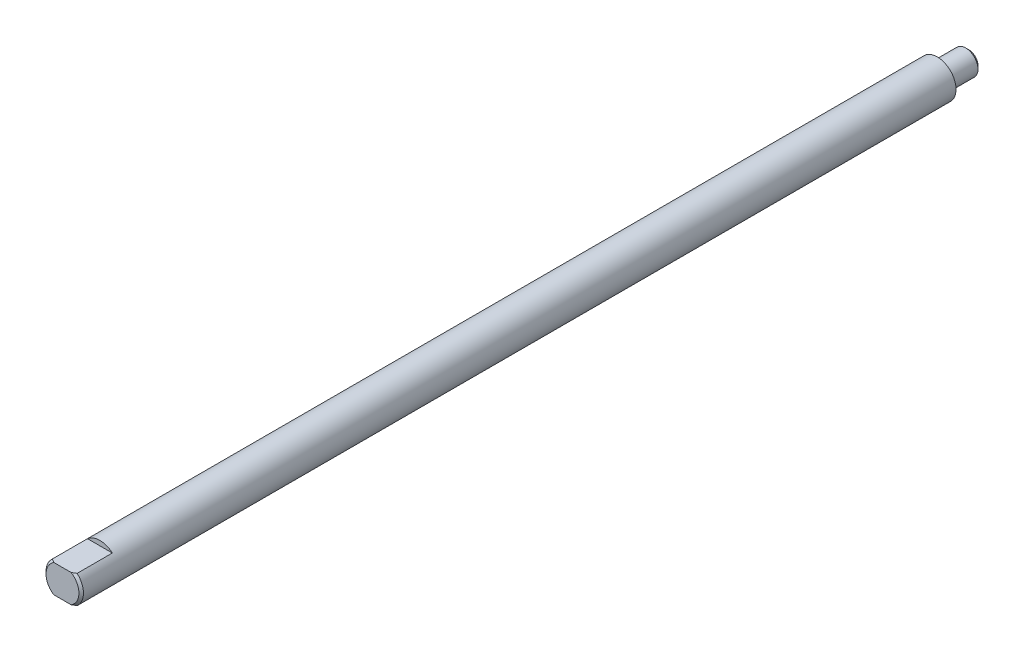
ISO-10303-21;
HEADER;
FILE_DESCRIPTION(('STEP AP214'),'2;1');
FILE_NAME('part.step','',(''),(''),'','','');
FILE_SCHEMA(('AUTOMOTIVE_DESIGN { 1 0 10303 214 1 1 1 1 }'));
ENDSEC;
DATA;
#1=APPLICATION_CONTEXT('core data for automotive mechanical design processes');
#2=APPLICATION_PROTOCOL_DEFINITION('international standard','automotive_design',2000,#1);
#3=PRODUCT_CONTEXT('',#1,'mechanical');
#4=PRODUCT('Part','Part','',(#3));
#5=PRODUCT_RELATED_PRODUCT_CATEGORY('part','',(#4));
#6=PRODUCT_DEFINITION_FORMATION('','',#4);
#7=PRODUCT_DEFINITION_CONTEXT('part definition',#1,'design');
#8=PRODUCT_DEFINITION('design','',#6,#7);
#9=PRODUCT_DEFINITION_SHAPE('','',#8);
#10=(LENGTH_UNIT() NAMED_UNIT(*) SI_UNIT(.MILLI.,.METRE.));
#11=(NAMED_UNIT(*) PLANE_ANGLE_UNIT() SI_UNIT($,.RADIAN.));
#12=(NAMED_UNIT(*) SI_UNIT($,.STERADIAN.) SOLID_ANGLE_UNIT());
#13=UNCERTAINTY_MEASURE_WITH_UNIT(LENGTH_MEASURE(1.E-05),#10,'distance_accuracy_value','');
#14=(GEOMETRIC_REPRESENTATION_CONTEXT(3) GLOBAL_UNCERTAINTY_ASSIGNED_CONTEXT((#13)) GLOBAL_UNIT_ASSIGNED_CONTEXT((#10,
#11,#12)) REPRESENTATION_CONTEXT('',''));
#15=CARTESIAN_POINT('',(0.,0.,0.));
#16=DIRECTION('',(0.,0.,1.));
#17=DIRECTION('',(1.,0.,0.));
#18=AXIS2_PLACEMENT_3D('',#15,#16,#17);
#19=CARTESIAN_POINT('',(0.,0.,3.684));
#20=DIRECTION('',(0.,0.,-1.));
#21=DIRECTION('',(-1.,0.,0.));
#22=AXIS2_PLACEMENT_3D('',#19,#20,#21);
#23=CONICAL_SURFACE('',#22,3.175,0.791934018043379);
#24=CARTESIAN_POINT('',(0.,0.,3.684));
#25=DIRECTION('',(0.,0.,1.));
#26=DIRECTION('',(1.,0.,0.));
#27=AXIS2_PLACEMENT_3D('',#24,#25,#26);
#28=CIRCLE('',#27,3.175);
#29=CARTESIAN_POINT('',(-2.10713075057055,2.375,3.684));
#30=VERTEX_POINT('',#29);
#31=CARTESIAN_POINT('',(-2.10713075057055,-2.375,3.684));
#32=VERTEX_POINT('',#31);
#33=EDGE_CURVE('E105',#30,#32,#28,.T.);
#34=ORIENTED_EDGE('',*,*,#33,.T.);
#35=CARTESIAN_POINT('',(-6.62966945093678,-2.375,-0.13301595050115));
#36=CARTESIAN_POINT('',(-6.41872085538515,-2.375,0.0629362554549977));
#37=CARTESIAN_POINT('',(-6.20729327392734,-2.375,0.258380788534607));
#38=CARTESIAN_POINT('',(-5.78286017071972,-2.375,0.64788739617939));
#39=CARTESIAN_POINT('',(-5.56985352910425,-2.375,0.841948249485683));
#40=CARTESIAN_POINT('',(-5.13574053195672,-2.375,1.23363349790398));
#41=CARTESIAN_POINT('',(-4.9145790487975,-2.375,1.43119690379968));
#42=CARTESIAN_POINT('',(-4.46963283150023,-2.375,1.82304516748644));
#43=CARTESIAN_POINT('',(-4.24585006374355,-2.375,2.01733224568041));
#44=CARTESIAN_POINT('',(-3.90719638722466,-2.375,2.30510248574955));
#45=CARTESIAN_POINT('',(-3.79385459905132,-2.375,2.40038380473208));
#46=CARTESIAN_POINT('',(-3.56590809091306,-2.375,2.5894215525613));
#47=CARTESIAN_POINT('',(-3.4513034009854,-2.375,2.68317801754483));
#48=CARTESIAN_POINT('',(-3.22025369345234,-2.375,2.86895465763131));
#49=CARTESIAN_POINT('',(-3.10380502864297,-2.375,2.96097030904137));
#50=CARTESIAN_POINT('',(-2.8689222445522,-2.375,3.14241965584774));
#51=CARTESIAN_POINT('',(-2.75048831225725,-2.375,3.23185359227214));
#52=CARTESIAN_POINT('',(-2.51255729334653,-2.375,3.40617108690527));
#53=CARTESIAN_POINT('',(-2.3930916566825,-2.375,3.49109735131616));
#54=CARTESIAN_POINT('',(-2.1509050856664,-2.375,3.65634247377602));
#55=CARTESIAN_POINT('',(-2.02818269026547,-2.375,3.73665921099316));
#56=CARTESIAN_POINT('',(-1.77912466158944,-2.375,3.89039659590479));
#57=CARTESIAN_POINT('',(-1.65280524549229,-2.375,3.96384327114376));
#58=CARTESIAN_POINT('',(-1.39512518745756,-2.375,4.10119391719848));
#59=CARTESIAN_POINT('',(-1.26377071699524,-2.375,4.16510912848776));
#60=CARTESIAN_POINT('',(-1.05701971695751,-2.375,4.25273595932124));
#61=CARTESIAN_POINT('',(-0.983728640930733,-2.375,4.28140199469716));
#62=CARTESIAN_POINT('',(-0.83535687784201,-2.375,4.3337772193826));
#63=CARTESIAN_POINT('',(-0.760275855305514,-2.375,4.35748547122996));
#64=CARTESIAN_POINT('',(-0.608898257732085,-2.375,4.39885359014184));
#65=CARTESIAN_POINT('',(-0.532610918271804,-2.375,4.41654679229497));
#66=CARTESIAN_POINT('',(-0.378780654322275,-2.375,4.445154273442));
#67=CARTESIAN_POINT('',(-0.301238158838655,-2.375,4.45607082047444));
#68=CARTESIAN_POINT('',(-0.144559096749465,-2.375,4.47054748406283));
#69=CARTESIAN_POINT('',(-0.0654144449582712,-2.375,4.47402190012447));
#70=CARTESIAN_POINT('',(0.0928249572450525,-2.375,4.47312081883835));
#71=CARTESIAN_POINT('',(0.171919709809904,-2.375,4.4687456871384));
#72=CARTESIAN_POINT('',(0.329626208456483,-2.375,4.45241265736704));
#73=CARTESIAN_POINT('',(0.408234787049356,-2.375,4.44042470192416));
#74=CARTESIAN_POINT('',(0.56408615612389,-2.375,4.40957980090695));
#75=CARTESIAN_POINT('',(0.641328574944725,-2.375,4.39072101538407));
#76=CARTESIAN_POINT('',(0.827865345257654,-2.375,4.33746225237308));
#77=CARTESIAN_POINT('',(0.936246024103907,-2.375,4.29987709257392));
#78=CARTESIAN_POINT('',(1.14927492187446,-2.375,4.21535984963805));
#79=CARTESIAN_POINT('',(1.25392057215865,-2.375,4.16842147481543));
#80=CARTESIAN_POINT('',(1.46087103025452,-2.375,4.06709514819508));
#81=CARTESIAN_POINT('',(1.56313950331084,-2.375,4.01263383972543));
#82=CARTESIAN_POINT('',(1.71427099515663,-2.375,3.92703840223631));
#83=CARTESIAN_POINT('',(1.76426245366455,-2.375,3.89786057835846));
#84=CARTESIAN_POINT('',(1.86356372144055,-2.375,3.83837009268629));
#85=CARTESIAN_POINT('',(1.91287355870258,-2.375,3.80805747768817));
#86=CARTESIAN_POINT('',(2.07522042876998,-2.375,3.70601224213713));
#87=CARTESIAN_POINT('',(2.18692206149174,-2.375,3.63215349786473));
#88=CARTESIAN_POINT('',(2.40772318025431,-2.375,3.48062951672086));
#89=CARTESIAN_POINT('',(2.5168220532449,-2.375,3.40296339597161));
#90=CARTESIAN_POINT('',(2.73301390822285,-2.375,3.24473477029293));
#91=CARTESIAN_POINT('',(2.84010537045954,-2.375,3.16417019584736));
#92=CARTESIAN_POINT('',(3.05261723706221,-2.375,3.00086187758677));
#93=CARTESIAN_POINT('',(3.15803753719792,-2.375,2.9181179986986));
#94=CARTESIAN_POINT('',(3.47300086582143,-2.375,2.6667998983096));
#95=CARTESIAN_POINT('',(3.68051445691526,-2.375,2.49568568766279));
#96=CARTESIAN_POINT('',(4.09182405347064,-2.375,2.14926116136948));
#97=CARTESIAN_POINT('',(4.29562161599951,-2.375,1.97395267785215));
#98=CARTESIAN_POINT('',(4.67931232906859,-2.375,1.63905531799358));
#99=CARTESIAN_POINT('',(4.85946034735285,-2.375,1.47975783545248));
#100=CARTESIAN_POINT('',(5.21824582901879,-2.375,1.15942835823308));
#101=CARTESIAN_POINT('',(5.39688309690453,-2.375,0.998396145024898));
#102=CARTESIAN_POINT('',(5.75173692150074,-2.375,0.676174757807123));
#103=CARTESIAN_POINT('',(5.92796166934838,-2.375,0.514994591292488));
#104=CARTESIAN_POINT('',(6.27946145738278,-2.375,0.191659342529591));
#105=CARTESIAN_POINT('',(6.45473664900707,-2.375,0.0295044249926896));
#106=CARTESIAN_POINT('',(6.62966945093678,-2.375,-0.13301595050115));
#107=B_SPLINE_CURVE_WITH_KNOTS('',3,(#35,#36,#37,#38,#39,#40,#41,#42,#43,#44,#45,#46,#47,#48,
#49,#50,#51,#52,#53,#54,#55,#56,#57,#58,#59,#60,#61,#62,#63,#64,#65,#66,#67,#68,#69,#70,#71,#72,
#73,#74,#75,#76,#77,#78,#79,#80,#81,#82,#83,#84,#85,#86,#87,#88,#89,#90,#91,#92,#93,#94,#95,#96,
#97,#98,#99,#100,#101,#102,#103,#104,#105,#106),.UNSPECIFIED.,.F.,.F.,(4,2,2,2,2,2,2,2,2,2,2,2,
2,2,2,2,2,2,2,2,2,2,2,2,2,2,2,2,2,2,2,2,2,2,2,4),(0.,0.863760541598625,1.72820709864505,
2.61784876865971,3.50686109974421,3.95106286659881,4.39525409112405,4.84047397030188,
5.28565214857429,5.72530383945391,6.16515621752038,6.60326828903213,7.04085953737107,
7.2768120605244,7.51280915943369,7.74747620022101,7.98206465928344,8.21934033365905,
8.45660495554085,8.69481223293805,8.93308334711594,9.27660606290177,9.62036064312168,
9.96774119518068,10.1413805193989,10.3150126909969,10.7166254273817,11.1183318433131,
11.5203310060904,11.9223551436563,12.7291420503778,13.5355827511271,14.2569976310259,
14.9785044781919,15.6949553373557,16.4112883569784),.UNSPECIFIED.);
#108=CARTESIAN_POINT('',(-1.46406113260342,-2.375,4.064));
#109=VERTEX_POINT('',#108);
#110=EDGE_CURVE('E128',#32,#109,#107,.T.);
#111=ORIENTED_EDGE('',*,*,#110,.T.);
#112=CARTESIAN_POINT('',(0.,0.,4.064));
#113=DIRECTION('',(0.,0.,1.));
#114=DIRECTION('',(1.,0.,0.));
#115=AXIS2_PLACEMENT_3D('',#112,#113,#114);
#116=CIRCLE('',#115,2.79);
#117=CARTESIAN_POINT('',(-1.46406113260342,2.375,4.064));
#118=VERTEX_POINT('',#117);
#119=EDGE_CURVE('E115',#118,#109,#116,.T.);
#120=ORIENTED_EDGE('',*,*,#119,.F.);
#121=CARTESIAN_POINT('',(6.62966945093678,2.375,-0.13301595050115));
#122=CARTESIAN_POINT('',(6.41872085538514,2.375,0.0629362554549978));
#123=CARTESIAN_POINT('',(6.20729327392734,2.375,0.258380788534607));
#124=CARTESIAN_POINT('',(5.78286017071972,2.375,0.64788739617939));
#125=CARTESIAN_POINT('',(5.56985352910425,2.375,0.841948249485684));
#126=CARTESIAN_POINT('',(5.13574053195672,2.375,1.23363349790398));
#127=CARTESIAN_POINT('',(4.9145790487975,2.375,1.43119690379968));
#128=CARTESIAN_POINT('',(4.46963283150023,2.375,1.82304516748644));
#129=CARTESIAN_POINT('',(4.24585006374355,2.375,2.01733224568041));
#130=CARTESIAN_POINT('',(3.90719638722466,2.375,2.30510248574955));
#131=CARTESIAN_POINT('',(3.79385459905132,2.375,2.40038380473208));
#132=CARTESIAN_POINT('',(3.56590809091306,2.375,2.5894215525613));
#133=CARTESIAN_POINT('',(3.4513034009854,2.375,2.68317801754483));
#134=CARTESIAN_POINT('',(3.22025369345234,2.375,2.86895465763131));
#135=CARTESIAN_POINT('',(3.10380502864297,2.375,2.96097030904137));
#136=CARTESIAN_POINT('',(2.8689222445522,2.375,3.14241965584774));
#137=CARTESIAN_POINT('',(2.75048831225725,2.375,3.23185359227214));
#138=CARTESIAN_POINT('',(2.51255729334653,2.375,3.40617108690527));
#139=CARTESIAN_POINT('',(2.3930916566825,2.375,3.49109735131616));
#140=CARTESIAN_POINT('',(2.1509050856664,2.375,3.65634247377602));
#141=CARTESIAN_POINT('',(2.02818269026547,2.375,3.73665921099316));
#142=CARTESIAN_POINT('',(1.77912466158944,2.375,3.89039659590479));
#143=CARTESIAN_POINT('',(1.65280524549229,2.375,3.96384327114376));
#144=CARTESIAN_POINT('',(1.39512518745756,2.375,4.10119391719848));
#145=CARTESIAN_POINT('',(1.26377071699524,2.375,4.16510912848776));
#146=CARTESIAN_POINT('',(1.05701971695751,2.375,4.25273595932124));
#147=CARTESIAN_POINT('',(0.983728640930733,2.375,4.28140199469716));
#148=CARTESIAN_POINT('',(0.83535687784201,2.375,4.3337772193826));
#149=CARTESIAN_POINT('',(0.760275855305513,2.375,4.35748547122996));
#150=CARTESIAN_POINT('',(0.608898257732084,2.375,4.39885359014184));
#151=CARTESIAN_POINT('',(0.532610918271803,2.375,4.41654679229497));
#152=CARTESIAN_POINT('',(0.378780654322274,2.375,4.445154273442));
#153=CARTESIAN_POINT('',(0.301238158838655,2.375,4.45607082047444));
#154=CARTESIAN_POINT('',(0.144559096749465,2.375,4.47054748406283));
#155=CARTESIAN_POINT('',(0.0654144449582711,2.375,4.47402190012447));
#156=CARTESIAN_POINT('',(-0.0928249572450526,2.375,4.47312081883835));
#157=CARTESIAN_POINT('',(-0.171919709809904,2.375,4.4687456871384));
#158=CARTESIAN_POINT('',(-0.329626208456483,2.375,4.45241265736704));
#159=CARTESIAN_POINT('',(-0.408234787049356,2.375,4.44042470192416));
#160=CARTESIAN_POINT('',(-0.56408615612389,2.375,4.40957980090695));
#161=CARTESIAN_POINT('',(-0.641328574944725,2.375,4.39072101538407));
#162=CARTESIAN_POINT('',(-0.827865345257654,2.375,4.33746225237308));
#163=CARTESIAN_POINT('',(-0.936246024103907,2.375,4.29987709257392));
#164=CARTESIAN_POINT('',(-1.14927492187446,2.375,4.21535984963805));
#165=CARTESIAN_POINT('',(-1.25392057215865,2.375,4.16842147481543));
#166=CARTESIAN_POINT('',(-1.46087103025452,2.375,4.06709514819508));
#167=CARTESIAN_POINT('',(-1.56313950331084,2.375,4.01263383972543));
#168=CARTESIAN_POINT('',(-1.71427099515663,2.375,3.92703840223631));
#169=CARTESIAN_POINT('',(-1.76426245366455,2.375,3.89786057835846));
#170=CARTESIAN_POINT('',(-1.86356372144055,2.375,3.83837009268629));
#171=CARTESIAN_POINT('',(-1.91287355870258,2.375,3.80805747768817));
#172=CARTESIAN_POINT('',(-2.07522042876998,2.375,3.70601224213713));
#173=CARTESIAN_POINT('',(-2.18692206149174,2.375,3.63215349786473));
#174=CARTESIAN_POINT('',(-2.40772318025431,2.375,3.48062951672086));
#175=CARTESIAN_POINT('',(-2.51682205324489,2.375,3.40296339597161));
#176=CARTESIAN_POINT('',(-2.73301390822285,2.375,3.24473477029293));
#177=CARTESIAN_POINT('',(-2.84010537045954,2.375,3.16417019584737));
#178=CARTESIAN_POINT('',(-3.05261723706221,2.375,3.00086187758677));
#179=CARTESIAN_POINT('',(-3.15803753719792,2.375,2.91811799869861));
#180=CARTESIAN_POINT('',(-3.47300086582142,2.375,2.66679989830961));
#181=CARTESIAN_POINT('',(-3.68051445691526,2.375,2.49568568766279));
#182=CARTESIAN_POINT('',(-4.09182405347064,2.375,2.14926116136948));
#183=CARTESIAN_POINT('',(-4.29562161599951,2.375,1.97395267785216));
#184=CARTESIAN_POINT('',(-4.67931232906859,2.375,1.63905531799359));
#185=CARTESIAN_POINT('',(-4.85946034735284,2.375,1.47975783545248));
#186=CARTESIAN_POINT('',(-5.21824582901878,2.375,1.15942835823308));
#187=CARTESIAN_POINT('',(-5.39688309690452,2.375,0.998396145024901));
#188=CARTESIAN_POINT('',(-5.75173692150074,2.375,0.676174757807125));
#189=CARTESIAN_POINT('',(-5.92796166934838,2.375,0.514994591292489));
#190=CARTESIAN_POINT('',(-6.27946145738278,2.375,0.191659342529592));
#191=CARTESIAN_POINT('',(-6.45473664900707,2.375,0.0295044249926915));
#192=CARTESIAN_POINT('',(-6.62966945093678,2.375,-0.13301595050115));
#193=B_SPLINE_CURVE_WITH_KNOTS('',3,(#121,#122,#123,#124,#125,#126,#127,#128,#129,#130,#131,
#132,#133,#134,#135,#136,#137,#138,#139,#140,#141,#142,#143,#144,#145,#146,#147,#148,#149,#150,
#151,#152,#153,#154,#155,#156,#157,#158,#159,#160,#161,#162,#163,#164,#165,#166,#167,#168,#169,
#170,#171,#172,#173,#174,#175,#176,#177,#178,#179,#180,#181,#182,#183,#184,#185,#186,#187,#188,
#189,#190,#191,#192),.UNSPECIFIED.,.F.,.F.,(4,2,2,2,2,2,2,2,2,2,2,2,2,2,2,2,2,2,2,2,2,2,2,2,2,2,
2,2,2,2,2,2,2,2,2,4),(0.,0.863760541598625,1.72820709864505,2.61784876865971,3.50686109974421,
3.95106286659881,4.39525409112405,4.84047397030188,5.28565214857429,5.72530383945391,
6.16515621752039,6.60326828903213,7.04085953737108,7.2768120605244,7.51280915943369,
7.74747620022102,7.98206465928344,8.21934033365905,8.45660495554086,8.69481223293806,
8.93308334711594,9.27660606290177,9.62036064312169,9.96774119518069,10.1413805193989,
10.3150126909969,10.7166254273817,11.1183318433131,11.5203310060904,11.9223551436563,
12.7291420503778,13.5355827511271,14.2569976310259,14.9785044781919,15.6949553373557,
16.4112883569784),.UNSPECIFIED.);
#194=EDGE_CURVE('E129',#118,#30,#193,.T.);
#195=ORIENTED_EDGE('',*,*,#194,.T.);
#196=EDGE_LOOP('',(#34,#111,#120,#195));
#197=FACE_BOUND('',#196,.T.);
#198=ADVANCED_FACE('F33',(#197),#23,.T.);
#199=CARTESIAN_POINT('',(0.,0.,4.064));
#200=DIRECTION('',(0.,0.,-1.));
#201=DIRECTION('',(-1.,0.,0.));
#202=AXIS2_PLACEMENT_3D('',#199,#200,#201);
#203=PLANE('',#202);
#204=ORIENTED_EDGE('',*,*,#119,.T.);
#205=DIRECTION('',(1.,0.,0.));
#206=VECTOR('',#205,1.);
#207=CARTESIAN_POINT('',(-5.,-2.375,4.064));
#208=LINE('',#207,#206);
#209=CARTESIAN_POINT('',(1.46406113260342,-2.375,4.064));
#210=VERTEX_POINT('',#209);
#211=EDGE_CURVE('E95',#109,#210,#208,.T.);
#212=ORIENTED_EDGE('',*,*,#211,.T.);
#213=CARTESIAN_POINT('',(1.46406113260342,2.375,4.064));
#214=VERTEX_POINT('',#213);
#215=EDGE_CURVE('E109',#210,#214,#116,.T.);
#216=ORIENTED_EDGE('',*,*,#215,.T.);
#217=DIRECTION('',(1.,0.,0.));
#218=VECTOR('',#217,1.);
#219=CARTESIAN_POINT('',(-5.,2.375,4.064));
#220=LINE('',#219,#218);
#221=EDGE_CURVE('E135',#118,#214,#220,.T.);
#222=ORIENTED_EDGE('',*,*,#221,.F.);
#223=EDGE_LOOP('',(#204,#212,#216,#222));
#224=FACE_BOUND('',#223,.T.);
#225=ADVANCED_FACE('F35',(#224),#203,.F.);
#226=ORIENTED_EDGE('',*,*,#215,.F.);
#227=CARTESIAN_POINT('',(2.10713075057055,-2.375,3.684));
#228=VERTEX_POINT('',#227);
#229=EDGE_CURVE('E94',#210,#228,#107,.T.);
#230=ORIENTED_EDGE('',*,*,#229,.T.);
#231=CARTESIAN_POINT('',(2.10713075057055,2.375,3.684));
#232=VERTEX_POINT('',#231);
#233=EDGE_CURVE('E101',#228,#232,#28,.T.);
#234=ORIENTED_EDGE('',*,*,#233,.T.);
#235=EDGE_CURVE('E132',#232,#214,#193,.T.);
#236=ORIENTED_EDGE('',*,*,#235,.T.);
#237=EDGE_LOOP('',(#226,#230,#234,#236));
#238=FACE_BOUND('',#237,.T.);
#239=ADVANCED_FACE('F144',(#238),#23,.T.);
#240=CARTESIAN_POINT('',(0.,0.,4.064));
#241=DIRECTION('',(0.,0.,1.));
#242=DIRECTION('',(1.,0.,0.));
#243=AXIS2_PLACEMENT_3D('',#240,#241,#242);
#244=CYLINDRICAL_SURFACE('',#243,3.175);
#245=ORIENTED_EDGE('',*,*,#233,.F.);
#246=DIRECTION('',(0.,0.,1.));
#247=VECTOR('',#246,1.);
#248=CARTESIAN_POINT('',(2.10713075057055,-2.375,4.064));
#249=LINE('',#248,#247);
#250=CARTESIAN_POINT('',(2.10713075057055,-2.375,-2.286));
#251=VERTEX_POINT('',#250);
#252=EDGE_CURVE('E11',#228,#251,#249,.F.);
#253=ORIENTED_EDGE('',*,*,#252,.T.);
#254=CARTESIAN_POINT('',(0.,0.,-2.28599999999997));
#255=DIRECTION('',(0.,0.,-1.));
#256=DIRECTION('',(0.,1.,0.));
#257=AXIS2_PLACEMENT_3D('',#254,#255,#256);
#258=CIRCLE('',#257,3.175);
#259=CARTESIAN_POINT('',(-2.10713075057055,-2.375,-2.286));
#260=VERTEX_POINT('',#259);
#261=EDGE_CURVE('E85',#251,#260,#258,.T.);
#262=ORIENTED_EDGE('',*,*,#261,.T.);
#263=DIRECTION('',(0.,0.,1.));
#264=VECTOR('',#263,1.);
#265=CARTESIAN_POINT('',(-2.10713075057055,-2.375,4.064));
#266=LINE('',#265,#264);
#267=EDGE_CURVE('E41',#260,#32,#266,.T.);
#268=ORIENTED_EDGE('',*,*,#267,.T.);
#269=ORIENTED_EDGE('',*,*,#33,.F.);
#270=DIRECTION('',(0.,0.,1.));
#271=VECTOR('',#270,1.);
#272=CARTESIAN_POINT('',(-2.10713075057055,2.375,4.064));
#273=LINE('',#272,#271);
#274=CARTESIAN_POINT('',(-2.10713075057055,2.375,-2.286));
#275=VERTEX_POINT('',#274);
#276=EDGE_CURVE('E118',#30,#275,#273,.F.);
#277=ORIENTED_EDGE('',*,*,#276,.T.);
#278=CARTESIAN_POINT('',(0.,0.,-2.28599999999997));
#279=DIRECTION('',(0.,0.,-1.));
#280=DIRECTION('',(0.,1.,0.));
#281=AXIS2_PLACEMENT_3D('',#278,#279,#280);
#282=CIRCLE('',#281,3.175);
#283=CARTESIAN_POINT('',(2.10713075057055,2.375,-2.286));
#284=VERTEX_POINT('',#283);
#285=EDGE_CURVE('E121',#275,#284,#282,.T.);
#286=ORIENTED_EDGE('',*,*,#285,.T.);
#287=DIRECTION('',(0.,0.,1.));
#288=VECTOR('',#287,1.);
#289=CARTESIAN_POINT('',(2.10713075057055,2.375,4.064));
#290=LINE('',#289,#288);
#291=EDGE_CURVE('E89',#284,#232,#290,.T.);
#292=ORIENTED_EDGE('',*,*,#291,.T.);
#293=EDGE_LOOP('',(#245,#253,#262,#268,#269,#277,#286,#292));
#294=FACE_BOUND('',#293,.T.);
#295=CARTESIAN_POINT('',(0.,0.,-144.3228));
#296=DIRECTION('',(0.,0.,1.));
#297=DIRECTION('',(1.,0.,0.));
#298=AXIS2_PLACEMENT_3D('',#295,#296,#297);
#299=CIRCLE('',#298,3.175);
#300=CARTESIAN_POINT('',(3.175,0.,-144.3228));
#301=VERTEX_POINT('',#300);
#302=EDGE_CURVE('E106',#301,#301,#299,.T.);
#303=ORIENTED_EDGE('',*,*,#302,.T.);
#304=EDGE_LOOP('',(#303));
#305=FACE_BOUND('',#304,.T.);
#306=ADVANCED_FACE('F98',(#294,#305),#244,.T.);
#307=CARTESIAN_POINT('',(0.,2.0828,-144.3228));
#308=DIRECTION('',(0.,0.,1.));
#309=DIRECTION('',(1.,0.,0.));
#310=AXIS2_PLACEMENT_3D('',#307,#308,#309);
#311=PLANE('',#310);
#312=ORIENTED_EDGE('',*,*,#302,.F.);
#313=EDGE_LOOP('',(#312));
#314=FACE_BOUND('',#313,.T.);
#315=CARTESIAN_POINT('',(0.,0.,-144.3228));
#316=DIRECTION('',(0.,0.,1.));
#317=DIRECTION('',(1.,0.,0.));
#318=AXIS2_PLACEMENT_3D('',#315,#316,#317);
#319=CIRCLE('',#318,2.0828);
#320=CARTESIAN_POINT('',(2.0828,0.,-144.3228));
#321=VERTEX_POINT('',#320);
#322=EDGE_CURVE('E111',#321,#321,#319,.T.);
#323=ORIENTED_EDGE('',*,*,#322,.T.);
#324=EDGE_LOOP('',(#323));
#325=FACE_BOUND('',#324,.T.);
#326=ADVANCED_FACE('F165',(#314,#325),#311,.F.);
#327=CARTESIAN_POINT('',(0.,0.,4.064));
#328=DIRECTION('',(0.,0.,1.));
#329=DIRECTION('',(1.,0.,0.));
#330=AXIS2_PLACEMENT_3D('',#327,#328,#329);
#331=CYLINDRICAL_SURFACE('',#330,2.0828);
#332=ORIENTED_EDGE('',*,*,#322,.F.);
#333=EDGE_LOOP('',(#332));
#334=FACE_BOUND('',#333,.T.);
#335=CARTESIAN_POINT('',(0.,0.,-149.1428));
#336=DIRECTION('',(0.,0.,1.));
#337=DIRECTION('',(1.,0.,0.));
#338=AXIS2_PLACEMENT_3D('',#335,#336,#337);
#339=CIRCLE('',#338,2.0828);
#340=CARTESIAN_POINT('',(2.0828,0.,-149.1428));
#341=VERTEX_POINT('',#340);
#342=EDGE_CURVE('E263',#341,#341,#339,.T.);
#343=ORIENTED_EDGE('',*,*,#342,.T.);
#344=EDGE_LOOP('',(#343));
#345=FACE_BOUND('',#344,.T.);
#346=ADVANCED_FACE('F161',(#334,#345),#331,.T.);
#347=CARTESIAN_POINT('',(0.,0.,-149.6528));
#348=DIRECTION('',(0.,0.,1.));
#349=DIRECTION('',(1.,0.,0.));
#350=AXIS2_PLACEMENT_3D('',#347,#348,#349);
#351=CONICAL_SURFACE('',#350,1.57280000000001,0.785398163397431);
#352=ORIENTED_EDGE('',*,*,#342,.F.);
#353=EDGE_LOOP('',(#352));
#354=FACE_BOUND('',#353,.T.);
#355=CARTESIAN_POINT('',(0.,0.,-149.6528));
#356=DIRECTION('',(0.,0.,1.));
#357=DIRECTION('',(1.,0.,0.));
#358=AXIS2_PLACEMENT_3D('',#355,#356,#357);
#359=CIRCLE('',#358,1.57280000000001);
#360=CARTESIAN_POINT('',(1.57280000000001,0.,-149.6528));
#361=VERTEX_POINT('',#360);
#362=EDGE_CURVE('E134',#361,#361,#359,.T.);
#363=ORIENTED_EDGE('',*,*,#362,.T.);
#364=EDGE_LOOP('',(#363));
#365=FACE_BOUND('',#364,.T.);
#366=ADVANCED_FACE('F157',(#354,#365),#351,.T.);
#367=CARTESIAN_POINT('',(0.,0.,-149.6528));
#368=DIRECTION('',(0.,0.,1.));
#369=DIRECTION('',(1.,0.,0.));
#370=AXIS2_PLACEMENT_3D('',#367,#368,#369);
#371=PLANE('',#370);
#372=ORIENTED_EDGE('',*,*,#362,.F.);
#373=EDGE_LOOP('',(#372));
#374=FACE_BOUND('',#373,.T.);
#375=ADVANCED_FACE('F154',(#374),#371,.F.);
#376=CARTESIAN_POINT('',(-5.,2.375,-2.286));
#377=DIRECTION('',(0.,0.,-1.));
#378=DIRECTION('',(0.,1.,0.));
#379=AXIS2_PLACEMENT_3D('',#376,#377,#378);
#380=PLANE('',#379);
#381=ORIENTED_EDGE('',*,*,#285,.F.);
#382=DIRECTION('',(1.,0.,0.));
#383=VECTOR('',#382,1.);
#384=CARTESIAN_POINT('',(-5.,2.375,-2.286));
#385=LINE('',#384,#383);
#386=EDGE_CURVE('E55',#275,#284,#385,.T.);
#387=ORIENTED_EDGE('',*,*,#386,.T.);
#388=EDGE_LOOP('',(#381,#387));
#389=FACE_BOUND('',#388,.T.);
#390=ADVANCED_FACE('F152',(#389),#380,.F.);
#391=CARTESIAN_POINT('',(-5.,2.375,4.064));
#392=DIRECTION('',(0.,-1.,0.));
#393=DIRECTION('',(0.,0.,-1.));
#394=AXIS2_PLACEMENT_3D('',#391,#392,#393);
#395=PLANE('',#394);
#396=ORIENTED_EDGE('',*,*,#291,.F.);
#397=ORIENTED_EDGE('',*,*,#386,.F.);
#398=ORIENTED_EDGE('',*,*,#276,.F.);
#399=ORIENTED_EDGE('',*,*,#194,.F.);
#400=ORIENTED_EDGE('',*,*,#221,.T.);
#401=ORIENTED_EDGE('',*,*,#235,.F.);
#402=EDGE_LOOP('',(#396,#397,#398,#399,#400,#401));
#403=FACE_BOUND('',#402,.T.);
#404=ADVANCED_FACE('F147',(#403),#395,.F.);
#405=CARTESIAN_POINT('',(-5.,-2.375,4.064));
#406=DIRECTION('',(0.,1.,0.));
#407=DIRECTION('',(0.,0.,1.));
#408=AXIS2_PLACEMENT_3D('',#405,#406,#407);
#409=PLANE('',#408);
#410=ORIENTED_EDGE('',*,*,#267,.F.);
#411=DIRECTION('',(1.,0.,0.));
#412=VECTOR('',#411,1.);
#413=CARTESIAN_POINT('',(-5.,-2.375,-2.286));
#414=LINE('',#413,#412);
#415=EDGE_CURVE('E47',#260,#251,#414,.T.);
#416=ORIENTED_EDGE('',*,*,#415,.T.);
#417=ORIENTED_EDGE('',*,*,#252,.F.);
#418=ORIENTED_EDGE('',*,*,#229,.F.);
#419=ORIENTED_EDGE('',*,*,#211,.F.);
#420=ORIENTED_EDGE('',*,*,#110,.F.);
#421=EDGE_LOOP('',(#410,#416,#417,#418,#419,#420));
#422=FACE_BOUND('',#421,.T.);
#423=ADVANCED_FACE('F92',(#422),#409,.F.);
#424=CARTESIAN_POINT('',(-5.,-2.375,-2.286));
#425=DIRECTION('',(0.,0.,-1.));
#426=DIRECTION('',(0.,1.,0.));
#427=AXIS2_PLACEMENT_3D('',#424,#425,#426);
#428=PLANE('',#427);
#429=ORIENTED_EDGE('',*,*,#415,.F.);
#430=ORIENTED_EDGE('',*,*,#261,.F.);
#431=EDGE_LOOP('',(#429,#430));
#432=FACE_BOUND('',#431,.T.);
#433=ADVANCED_FACE('F86',(#432),#428,.F.);
#434=CLOSED_SHELL('',(#198,#225,#239,#306,#326,#346,#366,#375,#390,#404,#423,#433));
#435=MANIFOLD_SOLID_BREP('B2',#434);
#436=ADVANCED_BREP_SHAPE_REPRESENTATION('',(#18,#435),#14);
#437=SHAPE_DEFINITION_REPRESENTATION(#9,#436);
ENDSEC;
END-ISO-10303-21;
